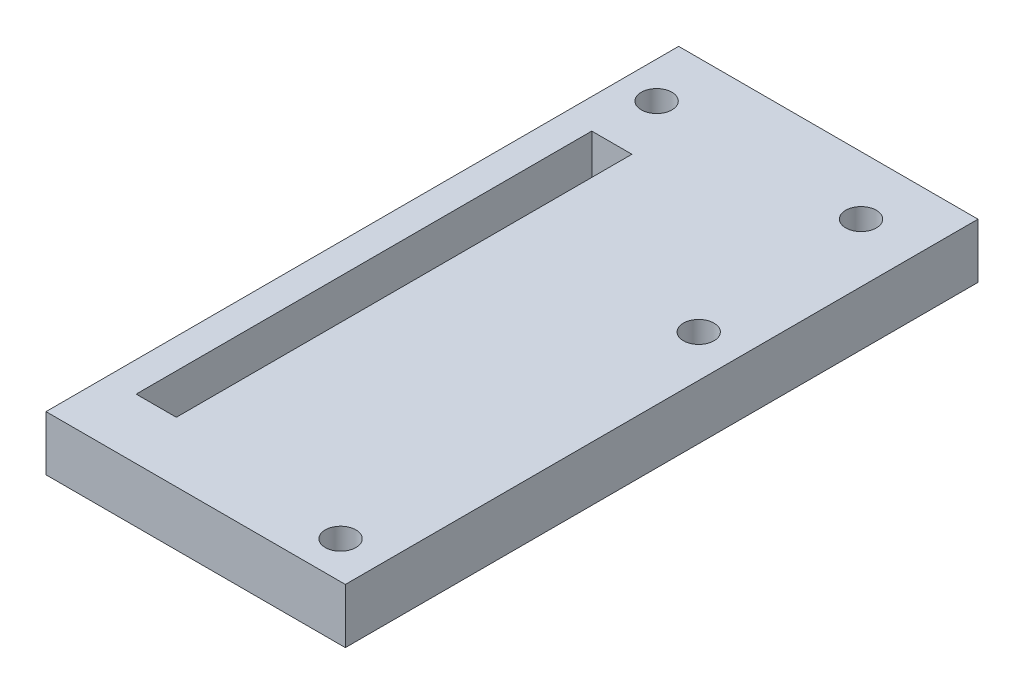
from build123d import *

# Parameters (mm, degrees)
SKETCH1_W           = 50
SKETCH1_H           = 86.65
BOSS_EXTRUDE1_DEPTH = 7.5
SKETCH7_W           = 5.5
SKETCH7_H           = 62.4
CUT_EXTRUDE5_DEPTH  = 5.95
SKETCH11_R          = 2.1
CUT_EXTRUDE8_DEPTH  = 51.579695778
SKETCH12_R          = 2.1
CUT_EXTRUDE10_DEPTH = 51.579695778
SKETCH13_W          = 86.65
SKETCH13_H          = 7.5
BOSS_EXTRUDE2_DEPTH = 1
SKETCH14_W          = 86.65
SKETCH14_H          = 7.5
CUT_EXTRUDE11_DEPTH = 10


with BuildPart() as part:
    # Sketch1 → Boss-Extrude1 (new body)
    with BuildSketch(Plane(origin=(0, 0, 0), x_dir=(1, 0, 0), z_dir=(0, 1, 0))):
        Rectangle(SKETCH1_W, SKETCH1_H)
    extrude(amount=BOSS_EXTRUDE1_DEPTH)

    # Sketch7 → Cut-Extrude5 (cut)
    with BuildSketch(Plane(origin=(0, 7.5, 0), x_dir=(1, 0, 0), z_dir=(0, 1, 0))):
        with Locations((-8.15, -3.875)):
            Rectangle(SKETCH7_W, SKETCH7_H)
    extrude(amount=-CUT_EXTRUDE5_DEPTH, mode=Mode.SUBTRACT)

    # Sketch11 → Cut-Extrude8 (cut, through all)
    with BuildSketch(Plane(origin=(0, 7.5, 0), x_dir=(1, 0, 0), z_dir=(0, 1, 0))):
        with Locations(Location((17.982, 35.325, 0), (0, 0, 270))):
            Circle(SKETCH11_R)
        with Locations(Location((-10.018, 35.325, 0), (0, 0, 270))):
            Circle(SKETCH11_R)
    extrude(amount=-CUT_EXTRUDE8_DEPTH, mode=Mode.SUBTRACT)

    # Sketch12 → Cut-Extrude10 (cut, through all)
    with BuildSketch(Plane(origin=(0, 7.5, 0), x_dir=(1, 0, 0), z_dir=(0, 1, 0))):
        with Locations(Location((20.25, 10.821, 0), (0, 0, 270))):
            Circle(SKETCH12_R)
        with Locations(Location((20.25, -38.229, 0), (0, 0, 270))):
            Circle(SKETCH12_R)
    extrude(amount=-CUT_EXTRUDE10_DEPTH, mode=Mode.SUBTRACT)

    # Sketch13 → Boss-Extrude2 (add)
    with BuildSketch(Plane(origin=(25, 0, 0), x_dir=(0, 0, -1), z_dir=(1, 0, 0))):
        with Locations((0, 3.75)):
            Rectangle(SKETCH13_W, SKETCH13_H)
    extrude(amount=BOSS_EXTRUDE2_DEPTH)

    # Sketch14 → Cut-Extrude11 (cut)
    with BuildSketch(Plane.ZY.offset(25)):
        with Locations((0, 3.75)):
            Rectangle(SKETCH14_W, SKETCH14_H)
    extrude(amount=-CUT_EXTRUDE11_DEPTH, mode=Mode.SUBTRACT)


solid = part.part
